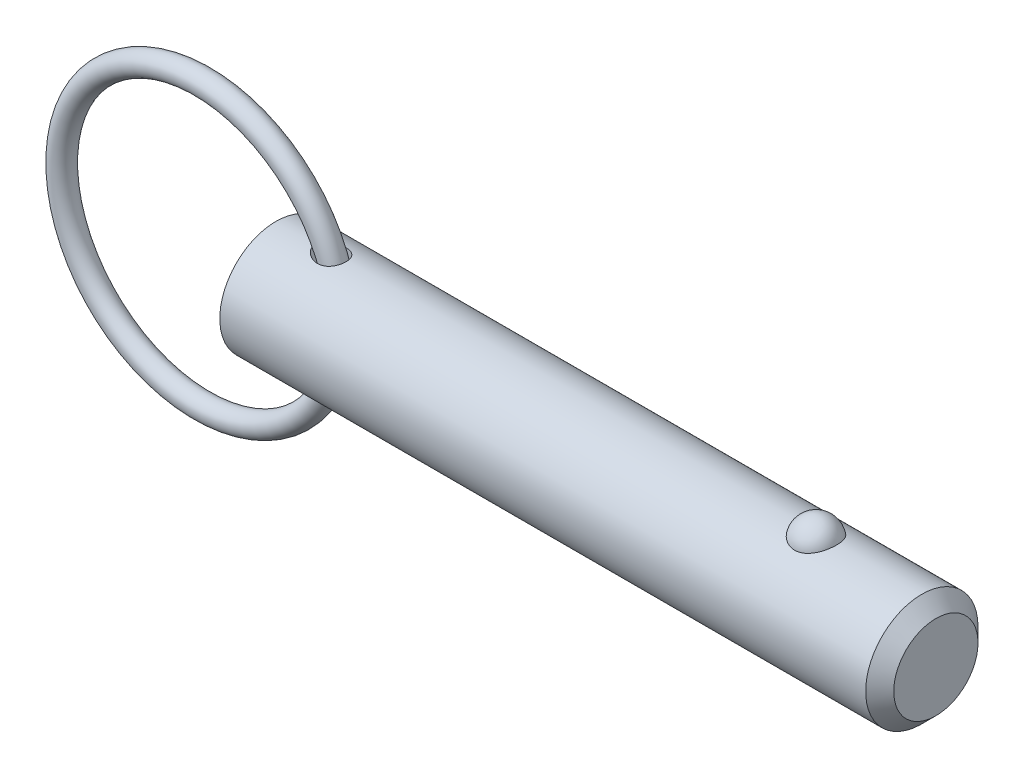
ISO-10303-21;
HEADER;
FILE_DESCRIPTION(('STEP AP214'),'2;1');
FILE_NAME('part.step','',(''),(''),'','','');
FILE_SCHEMA(('AUTOMOTIVE_DESIGN { 1 0 10303 214 1 1 1 1 }'));
ENDSEC;
DATA;
#1=APPLICATION_CONTEXT('core data for automotive mechanical design processes');
#2=APPLICATION_PROTOCOL_DEFINITION('international standard','automotive_design',2000,#1);
#3=PRODUCT_CONTEXT('',#1,'mechanical');
#4=PRODUCT('Part','Part','',(#3));
#5=PRODUCT_RELATED_PRODUCT_CATEGORY('part','',(#4));
#6=PRODUCT_DEFINITION_FORMATION('','',#4);
#7=PRODUCT_DEFINITION_CONTEXT('part definition',#1,'design');
#8=PRODUCT_DEFINITION('design','',#6,#7);
#9=PRODUCT_DEFINITION_SHAPE('','',#8);
#10=(LENGTH_UNIT() NAMED_UNIT(*) SI_UNIT(.MILLI.,.METRE.));
#11=(NAMED_UNIT(*) PLANE_ANGLE_UNIT() SI_UNIT($,.RADIAN.));
#12=(NAMED_UNIT(*) SI_UNIT($,.STERADIAN.) SOLID_ANGLE_UNIT());
#13=UNCERTAINTY_MEASURE_WITH_UNIT(LENGTH_MEASURE(1.E-05),#10,'distance_accuracy_value','');
#14=(GEOMETRIC_REPRESENTATION_CONTEXT(3) GLOBAL_UNCERTAINTY_ASSIGNED_CONTEXT((#13)) GLOBAL_UNIT_ASSIGNED_CONTEXT((#10,
#11,#12)) REPRESENTATION_CONTEXT('',''));
#15=CARTESIAN_POINT('',(0.,0.,0.));
#16=DIRECTION('',(0.,0.,1.));
#17=DIRECTION('',(1.,0.,0.));
#18=AXIS2_PLACEMENT_3D('',#15,#16,#17);
#19=CARTESIAN_POINT('',(-8.34703434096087,0.,0.));
#20=DIRECTION('',(0.,0.,1.));
#21=DIRECTION('',(1.,0.,0.));
#22=AXIS2_PLACEMENT_3D('',#19,#20,#21);
#23=TOROIDAL_SURFACE('',#22,15.875,1.27);
#24=CARTESIAN_POINT('',(8.79796565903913,0.,0.));
#25=VERTEX_POINT('',#24);
#26=VERTEX_LOOP('',#25);
#27=FACE_BOUND('',#26,.T.);
#28=ADVANCED_FACE('P0_F12',(#27),#23,.T.);
#29=CLOSED_SHELL('',(#28));
#30=MANIFOLD_SOLID_BREP('P0_B1',#29);
#31=CARTESIAN_POINT('',(0.,0.,0.));
#32=DIRECTION('',(1.,0.,0.));
#33=DIRECTION('',(0.,0.,-1.));
#34=AXIS2_PLACEMENT_3D('',#31,#32,#33);
#35=CYLINDRICAL_SURFACE('',#34,6.35);
#36=CARTESIAN_POINT('',(4.87230670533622,6.27273159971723,-0.987592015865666));
#37=CARTESIAN_POINT('',(4.94734735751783,6.26035058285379,-1.06623378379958));
#38=CARTESIAN_POINT('',(5.02968768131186,6.24755813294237,-1.13788608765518));
#39=CARTESIAN_POINT('',(5.2053426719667,6.22278258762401,-1.26640223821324));
#40=CARTESIAN_POINT('',(5.29867273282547,6.21080066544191,-1.32324497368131));
#41=CARTESIAN_POINT('',(5.49318962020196,6.18912414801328,-1.42117930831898));
#42=CARTESIAN_POINT('',(5.59435470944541,6.17942350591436,-1.46231273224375));
#43=CARTESIAN_POINT('',(5.80219659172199,6.16352555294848,-1.52793951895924));
#44=CARTESIAN_POINT('',(5.90887152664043,6.15732706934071,-1.55243845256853));
#45=CARTESIAN_POINT('',(6.12818220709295,6.14931784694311,-1.58387975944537));
#46=CARTESIAN_POINT('',(6.24090110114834,6.14763959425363,-1.59029227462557));
#47=CARTESIAN_POINT('',(6.46560233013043,6.14965588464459,-1.58248630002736));
#48=CARTESIAN_POINT('',(6.57758514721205,6.15334646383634,-1.56828303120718));
#49=CARTESIAN_POINT('',(6.78516594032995,6.1652116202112,-1.52091398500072));
#50=CARTESIAN_POINT('',(6.88126802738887,6.17288876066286,-1.48983713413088));
#51=CARTESIAN_POINT('',(7.06576629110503,6.19149190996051,-1.41052329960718));
#52=CARTESIAN_POINT('',(7.15416739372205,6.20241582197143,-1.36229738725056));
#53=CARTESIAN_POINT('',(7.31166929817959,6.2248616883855,-1.25548983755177));
#54=CARTESIAN_POINT('',(7.3818144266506,6.23621734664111,-1.19840625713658));
#55=CARTESIAN_POINT('',(7.51101296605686,6.259037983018,-1.07284763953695));
#56=CARTESIAN_POINT('',(7.57006844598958,6.2705029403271,-1.00437473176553));
#57=CARTESIAN_POINT('',(7.6737469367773,6.29184873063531,-0.860384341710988));
#58=CARTESIAN_POINT('',(7.71876694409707,6.30176816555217,-0.785157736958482));
#59=CARTESIAN_POINT('',(7.79574491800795,6.31935829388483,-0.628053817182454));
#60=CARTESIAN_POINT('',(7.82770308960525,6.32702902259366,-0.546176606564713));
#61=CARTESIAN_POINT('',(7.87788845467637,6.33930929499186,-0.377876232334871));
#62=CARTESIAN_POINT('',(7.89608106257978,6.34391112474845,-0.291442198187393));
#63=CARTESIAN_POINT('',(7.9182072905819,6.34953044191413,-0.116652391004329));
#64=CARTESIAN_POINT('',(7.92214044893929,6.35054781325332,-0.0282965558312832));
#65=CARTESIAN_POINT('',(7.91564686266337,6.34888556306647,0.148263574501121));
#66=CARTESIAN_POINT('',(7.90515337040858,6.34618875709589,0.236465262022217));
#67=CARTESIAN_POINT('',(7.8699153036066,6.33735741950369,0.409798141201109));
#68=CARTESIAN_POINT('',(7.84517062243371,6.33122286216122,0.494929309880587));
#69=CARTESIAN_POINT('',(7.7819985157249,6.31618517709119,0.659657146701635));
#70=CARTESIAN_POINT('',(7.74357645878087,6.30728313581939,0.739255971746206));
#71=CARTESIAN_POINT('',(7.65396632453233,6.28769050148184,0.890663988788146));
#72=CARTESIAN_POINT('',(7.60277911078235,6.27700002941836,0.962473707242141));
#73=CARTESIAN_POINT('',(7.48925881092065,6.2550822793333,1.09590260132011));
#74=CARTESIAN_POINT('',(7.42698604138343,6.24385813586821,1.15757361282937));
#75=CARTESIAN_POINT('',(7.29283556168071,6.2220655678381,1.26951234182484));
#76=CARTESIAN_POINT('',(7.22095880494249,6.21149707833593,1.31978118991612));
#77=CARTESIAN_POINT('',(7.06971853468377,6.19216002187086,1.40772509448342));
#78=CARTESIAN_POINT('',(6.99035873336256,6.18339056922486,1.44540635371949));
#79=CARTESIAN_POINT('',(6.82642723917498,6.16851603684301,1.50762653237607));
#80=CARTESIAN_POINT('',(6.7418548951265,6.16241129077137,1.53216380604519));
#81=CARTESIAN_POINT('',(6.56686412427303,6.15321474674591,1.56869994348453));
#82=CARTESIAN_POINT('',(6.47634467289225,6.15023369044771,1.58023897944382));
#83=CARTESIAN_POINT('',(6.29456956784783,6.14778331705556,1.58974172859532));
#84=CARTESIAN_POINT('',(6.20331368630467,6.1483151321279,1.58770106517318));
#85=CARTESIAN_POINT('',(6.01385969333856,6.15284811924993,1.5700487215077));
#86=CARTESIAN_POINT('',(5.91578322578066,6.15715979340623,1.55322212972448));
#87=CARTESIAN_POINT('',(5.72331909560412,6.16902415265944,1.5054032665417));
#88=CARTESIAN_POINT('',(5.6289344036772,6.17657939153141,1.4743998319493));
#89=CARTESIAN_POINT('',(5.4357260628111,6.19502494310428,1.39499475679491));
#90=CARTESIAN_POINT('',(5.33755891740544,6.20619097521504,1.34505268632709));
#91=CARTESIAN_POINT('',(5.15090047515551,6.23006191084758,1.22975103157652));
#92=CARTESIAN_POINT('',(5.06240741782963,6.24276653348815,1.16439425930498));
#93=CARTESIAN_POINT('',(4.91171642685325,6.26607433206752,1.03083814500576));
#94=CARTESIAN_POINT('',(4.84758224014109,6.27668356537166,0.964825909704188));
#95=CARTESIAN_POINT('',(4.73090054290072,6.29683133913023,0.823112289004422));
#96=CARTESIAN_POINT('',(4.67833688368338,6.30637136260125,0.747424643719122));
#97=CARTESIAN_POINT('',(4.59543145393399,6.32183254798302,0.601150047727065));
#98=CARTESIAN_POINT('',(4.56283099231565,6.32809321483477,0.531883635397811));
#99=CARTESIAN_POINT('',(4.50941370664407,6.33849198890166,0.388778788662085));
#100=CARTESIAN_POINT('',(4.48858876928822,6.34263155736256,0.314943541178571));
#101=CARTESIAN_POINT('',(4.46008864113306,6.3483236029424,0.164282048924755));
#102=CARTESIAN_POINT('',(4.45247558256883,6.34986385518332,0.08744340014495));
#103=CARTESIAN_POINT('',(4.45121096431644,6.35011863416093,-0.0663538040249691));
#104=CARTESIAN_POINT('',(4.45755802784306,6.34883343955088,-0.143312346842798));
#105=CARTESIAN_POINT('',(4.48267656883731,6.34380948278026,-0.288945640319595));
#106=CARTESIAN_POINT('',(4.50045680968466,6.34026665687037,-0.357802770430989));
#107=CARTESIAN_POINT('',(4.54636050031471,6.33128211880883,-0.491815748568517));
#108=CARTESIAN_POINT('',(4.57448566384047,6.32584009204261,-0.556970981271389));
#109=CARTESIAN_POINT('',(4.64209700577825,6.31308107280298,-0.687092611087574));
#110=CARTESIAN_POINT('',(4.68226903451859,6.30565525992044,-0.751689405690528));
#111=CARTESIAN_POINT('',(4.77120834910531,6.28979741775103,-0.874524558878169));
#112=CARTESIAN_POINT('',(4.81998302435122,6.28136452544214,-0.932757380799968));
#113=CARTESIAN_POINT('',(4.87230670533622,6.27273159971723,-0.987592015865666));
#114=B_SPLINE_CURVE_WITH_KNOTS('',3,(#36,#37,#38,#39,#40,#41,#42,#43,#44,#45,#46,#47,#48,#49,
#50,#51,#52,#53,#54,#55,#56,#57,#58,#59,#60,#61,#62,#63,#64,#65,#66,#67,#68,#69,#70,#71,#72,#73,
#74,#75,#76,#77,#78,#79,#80,#81,#82,#83,#84,#85,#86,#87,#88,#89,#90,#91,#92,#93,#94,#95,#96,#97,
#98,#99,#100,#101,#102,#103,#104,#105,#106,#107,#108,#109,#110,#111,#112,#113),.UNSPECIFIED.,
.T.,.F.,(4,2,2,2,2,2,2,2,2,2,2,2,2,2,2,2,2,2,2,2,2,2,2,2,2,2,2,2,2,2,2,2,2,2,2,2,2,2,4),(0.,
0.327902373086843,0.65626964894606,0.983756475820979,1.31113357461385,1.64800657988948,
1.98463099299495,2.28681225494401,2.58879878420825,2.86088594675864,3.13292229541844,
3.3963648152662,3.65980320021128,3.92390128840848,4.18800792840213,4.45334062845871,
4.7186753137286,4.98390596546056,5.24911867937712,5.51293017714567,5.7767155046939,
6.04037065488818,6.30405880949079,6.57680801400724,6.84964512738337,7.14724526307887,
7.44508014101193,7.77572668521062,8.10631295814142,8.38318772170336,8.65967357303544,
8.88915303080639,9.11847418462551,9.34887088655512,9.57924486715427,9.79193291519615,
10.0046562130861,10.2330958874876,10.4617327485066),.UNSPECIFIED.);
#115=CARTESIAN_POINT('',(4.87230670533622,6.27273159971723,-0.987592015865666));
#116=VERTEX_POINT('',#115);
#117=EDGE_CURVE('P1_E40',#116,#116,#114,.T.);
#118=ORIENTED_EDGE('',*,*,#117,.T.);
#119=EDGE_LOOP('',(#118));
#120=FACE_BOUND('',#119,.T.);
#121=CARTESIAN_POINT('',(73.0125,0.,0.));
#122=DIRECTION('',(1.,0.,0.));
#123=DIRECTION('',(0.,0.,-1.));
#124=AXIS2_PLACEMENT_3D('',#121,#122,#123);
#125=CIRCLE('',#124,6.35);
#126=CARTESIAN_POINT('',(73.0125,0.,-6.35));
#127=VERTEX_POINT('',#126);
#128=EDGE_CURVE('P1_E25',#127,#127,#125,.T.);
#129=ORIENTED_EDGE('',*,*,#128,.F.);
#130=EDGE_LOOP('',(#129));
#131=FACE_BOUND('',#130,.T.);
#132=CARTESIAN_POINT('',(0.,0.,0.));
#133=DIRECTION('',(1.,0.,0.));
#134=DIRECTION('',(0.,0.,-1.));
#135=AXIS2_PLACEMENT_3D('',#132,#133,#134);
#136=CIRCLE('',#135,6.35);
#137=CARTESIAN_POINT('',(0.,0.,-6.35));
#138=VERTEX_POINT('',#137);
#139=EDGE_CURVE('P1_E9',#138,#138,#136,.T.);
#140=ORIENTED_EDGE('',*,*,#139,.T.);
#141=EDGE_LOOP('',(#140));
#142=FACE_BOUND('',#141,.T.);
#143=CARTESIAN_POINT('',(61.0500214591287,5.87502187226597,2.40969251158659));
#144=CARTESIAN_POINT('',(60.9250305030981,5.87501645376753,2.40969773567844));
#145=CARTESIAN_POINT('',(60.8000806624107,5.87916061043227,2.39967292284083));
#146=CARTESIAN_POINT('',(60.5539091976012,5.8952311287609,2.3599173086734));
#147=CARTESIAN_POINT('',(60.4326863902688,5.90715499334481,2.33019283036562));
#148=CARTESIAN_POINT('',(60.1975170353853,5.93739567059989,2.25201402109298));
#149=CARTESIAN_POINT('',(60.0835602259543,5.95570321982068,2.20358681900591));
#150=CARTESIAN_POINT('',(59.86557352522,5.99672067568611,2.08937987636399));
#151=CARTESIAN_POINT('',(59.7615457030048,6.01943149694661,2.02359652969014));
#152=CARTESIAN_POINT('',(59.5629437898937,6.06760647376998,1.87428969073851));
#153=CARTESIAN_POINT('',(59.4687268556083,6.09313095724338,1.79031110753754));
#154=CARTESIAN_POINT('',(59.2952557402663,6.14375873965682,1.60800178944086));
#155=CARTESIAN_POINT('',(59.2160043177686,6.16886196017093,1.50966841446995));
#156=CARTESIAN_POINT('',(59.0708457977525,6.21724600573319,1.29645884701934));
#157=CARTESIAN_POINT('',(59.0056885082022,6.24039621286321,1.18104158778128));
#158=CARTESIAN_POINT('',(58.8947035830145,6.28117277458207,0.940351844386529));
#159=CARTESIAN_POINT('',(58.8488776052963,6.29879865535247,0.815078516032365));
#160=CARTESIAN_POINT('',(58.7770234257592,6.32692073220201,0.556494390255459));
#161=CARTESIAN_POINT('',(58.751249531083,6.33732517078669,0.423102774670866));
#162=CARTESIAN_POINT('',(58.7209885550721,6.34957673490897,0.15354272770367));
#163=CARTESIAN_POINT('',(58.7165009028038,6.35142408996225,0.0173743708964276));
#164=CARTESIAN_POINT('',(58.7288655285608,6.34638925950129,-0.253036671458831));
#165=CARTESIAN_POINT('',(58.7455949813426,6.33955731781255,-0.387285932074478));
#166=CARTESIAN_POINT('',(58.799843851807,6.31794129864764,-0.650851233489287));
#167=CARTESIAN_POINT('',(58.8373636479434,6.30315707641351,-0.780167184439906));
#168=CARTESIAN_POINT('',(58.932500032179,6.26711642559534,-1.03041949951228));
#169=CARTESIAN_POINT('',(58.990143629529,6.24585130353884,-1.15134433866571));
#170=CARTESIAN_POINT('',(59.1243522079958,6.19905619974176,-1.38129800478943));
#171=CARTESIAN_POINT('',(59.2009187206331,6.17352587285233,-1.49032586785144));
#172=CARTESIAN_POINT('',(59.3717538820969,6.12080227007,-1.69393164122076));
#173=CARTESIAN_POINT('',(59.4661008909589,6.09360200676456,-1.78844209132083));
#174=CARTESIAN_POINT('',(59.6701196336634,6.04070434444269,-1.95970536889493));
#175=CARTESIAN_POINT('',(59.7797900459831,6.01500681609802,-2.03645972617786));
#176=CARTESIAN_POINT('',(60.0091876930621,5.96867714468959,-2.1684564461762));
#177=CARTESIAN_POINT('',(60.1286522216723,5.94794910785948,-2.2241206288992));
#178=CARTESIAN_POINT('',(60.3762188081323,5.91340580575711,-2.31440992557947));
#179=CARTESIAN_POINT('',(60.5043175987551,5.89958794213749,-2.3490429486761));
#180=CARTESIAN_POINT('',(60.758582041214,5.88111049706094,-2.39491590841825));
#181=CARTESIAN_POINT('',(60.8845207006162,5.87602512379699,-2.40724512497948));
#182=CARTESIAN_POINT('',(61.1367867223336,5.87428980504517,-2.41147867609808));
#183=CARTESIAN_POINT('',(61.263114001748,5.87763817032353,-2.40338710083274));
#184=CARTESIAN_POINT('',(61.5084170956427,5.89212921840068,-2.36762715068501));
#185=CARTESIAN_POINT('',(61.6274992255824,5.90302431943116,-2.34058030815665));
#186=CARTESIAN_POINT('',(61.8592447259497,5.93113752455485,-2.26839066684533));
#187=CARTESIAN_POINT('',(61.9719075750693,5.94835614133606,-2.22324640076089));
#188=CARTESIAN_POINT('',(62.1904009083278,5.98773016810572,-2.11493806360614));
#189=CARTESIAN_POINT('',(62.296028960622,6.00998499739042,-2.05140269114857));
#190=CARTESIAN_POINT('',(62.4953006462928,6.05690144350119,-1.90842705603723));
#191=CARTESIAN_POINT('',(62.5889415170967,6.08156361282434,-1.8289831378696));
#192=CARTESIAN_POINT('',(62.7666754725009,6.13211715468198,-1.65182429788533));
#193=CARTESIAN_POINT('',(62.850055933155,6.15800825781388,-1.55339381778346));
#194=CARTESIAN_POINT('',(62.9997900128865,6.20712834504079,-1.34374214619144));
#195=CARTESIAN_POINT('',(63.0661405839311,6.23035685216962,-1.23251867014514));
#196=CARTESIAN_POINT('',(63.1823455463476,6.27251177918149,-0.996447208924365));
#197=CARTESIAN_POINT('',(63.2316072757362,6.29127762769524,-0.871278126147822));
#198=CARTESIAN_POINT('',(63.3096142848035,6.3215862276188,-0.613870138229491));
#199=CARTESIAN_POINT('',(63.3383593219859,6.33312889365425,-0.481631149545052));
#200=CARTESIAN_POINT('',(63.3747705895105,6.34782349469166,-0.213672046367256));
#201=CARTESIAN_POINT('',(63.3824134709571,6.35096613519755,-0.0779482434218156));
#202=CARTESIAN_POINT('',(63.3763951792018,6.34851322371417,0.192943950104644));
#203=CARTESIAN_POINT('',(63.3627343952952,6.3429178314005,0.328112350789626));
#204=CARTESIAN_POINT('',(63.3145036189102,6.32360512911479,0.593406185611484));
#205=CARTESIAN_POINT('',(63.2800313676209,6.30992579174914,0.723552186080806));
#206=CARTESIAN_POINT('',(63.1909539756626,6.27586325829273,0.975834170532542));
#207=CARTESIAN_POINT('',(63.1363476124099,6.25547965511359,1.09796966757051));
#208=CARTESIAN_POINT('',(63.0077587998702,6.20998183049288,1.33148921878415));
#209=CARTESIAN_POINT('',(62.9336742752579,6.18484288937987,1.44281227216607));
#210=CARTESIAN_POINT('',(62.7678204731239,6.13258735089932,1.65087683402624));
#211=CARTESIAN_POINT('',(62.6760515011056,6.10547078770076,1.74761859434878));
#212=CARTESIAN_POINT('',(62.4771839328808,6.0523587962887,1.92350926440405));
#213=CARTESIAN_POINT('',(62.370133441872,6.0263601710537,2.00271146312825));
#214=CARTESIAN_POINT('',(62.1431384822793,5.97843747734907,2.14154159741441));
#215=CARTESIAN_POINT('',(62.023191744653,5.95651412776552,2.20116608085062));
#216=CARTESIAN_POINT('',(61.7645236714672,5.91812106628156,2.30250570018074));
#217=CARTESIAN_POINT('',(61.6250698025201,5.90217533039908,2.34256795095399));
#218=CARTESIAN_POINT('',(61.3403974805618,5.88063128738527,2.39615214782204));
#219=CARTESIAN_POINT('',(61.1951817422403,5.8750281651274,2.40968644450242));
#220=CARTESIAN_POINT('',(61.0500214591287,5.87502187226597,2.40969251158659));
#221=B_SPLINE_CURVE_WITH_KNOTS('',3,(#143,#144,#145,#146,#147,#148,#149,#150,#151,#152,#153,
#154,#155,#156,#157,#158,#159,#160,#161,#162,#163,#164,#165,#166,#167,#168,#169,#170,#171,#172,
#173,#174,#175,#176,#177,#178,#179,#180,#181,#182,#183,#184,#185,#186,#187,#188,#189,#190,#191,
#192,#193,#194,#195,#196,#197,#198,#199,#200,#201,#202,#203,#204,#205,#206,#207,#208,#209,#210,
#211,#212,#213,#214,#215,#216,#217,#218,#219,#220),.UNSPECIFIED.,.T.,.F.,(4,2,2,2,2,2,2,2,2,2,2,
2,2,2,2,2,2,2,2,2,2,2,2,2,2,2,2,2,2,2,2,2,2,2,2,2,2,2,4),(0.,0.374440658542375,0.74876119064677,
1.12254078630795,1.49639810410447,1.88098871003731,2.26565013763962,2.6674110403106,
3.06920639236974,3.47601794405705,3.88281858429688,4.28727498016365,4.69173873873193,
5.09674745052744,5.50178895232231,5.90865911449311,6.31549420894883,6.71369855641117,
7.11175305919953,7.48978077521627,7.86773278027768,8.2338388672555,8.59997464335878,
8.97409044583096,9.34829231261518,9.74122667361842,10.1342313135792,10.5397522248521,
10.9452779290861,11.3512521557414,11.7572189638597,12.1612938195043,12.5653932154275,
12.9716540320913,13.3779078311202,13.7829098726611,14.1879832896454,14.6230486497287,
15.0579114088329),.UNSPECIFIED.);
#222=CARTESIAN_POINT('',(61.0500214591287,5.87502187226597,2.40969251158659));
#223=VERTEX_POINT('',#222);
#224=EDGE_CURVE('P1_E34',#223,#223,#221,.T.);
#225=ORIENTED_EDGE('',*,*,#224,.T.);
#226=EDGE_LOOP('',(#225));
#227=FACE_BOUND('',#226,.T.);
#228=CARTESIAN_POINT('',(4.87230670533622,-6.27273159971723,-0.987592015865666));
#229=CARTESIAN_POINT('',(4.81440819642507,-6.28228431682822,-0.926913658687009));
#230=CARTESIAN_POINT('',(4.76085022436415,-6.29159289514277,-0.862071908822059));
#231=CARTESIAN_POINT('',(4.66448472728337,-6.3088950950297,-0.72465504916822));
#232=CARTESIAN_POINT('',(4.62166818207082,-6.31688981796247,-0.652086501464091));
#233=CARTESIAN_POINT('',(4.54882773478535,-6.33076917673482,-0.49974775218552));
#234=CARTESIAN_POINT('',(4.51891553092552,-6.33663532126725,-0.419921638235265));
#235=CARTESIAN_POINT('',(4.47476924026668,-6.3453711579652,-0.255882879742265));
#236=CARTESIAN_POINT('',(4.46051880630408,-6.34824397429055,-0.171674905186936));
#237=CARTESIAN_POINT('',(4.44966179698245,-6.35043041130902,-0.0120763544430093));
#238=CARTESIAN_POINT('',(4.45117530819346,-6.35012328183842,0.0631849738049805));
#239=CARTESIAN_POINT('',(4.46726452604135,-6.34689000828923,0.212230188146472));
#240=CARTESIAN_POINT('',(4.48184026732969,-6.3439638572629,0.286014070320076));
#241=CARTESIAN_POINT('',(4.52202068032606,-6.33603071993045,0.426550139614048));
#242=CARTESIAN_POINT('',(4.54707079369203,-6.33112875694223,0.493469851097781));
#243=CARTESIAN_POINT('',(4.6066985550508,-6.31972370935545,0.622743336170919));
#244=CARTESIAN_POINT('',(4.64127887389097,-6.31322017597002,0.685095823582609));
#245=CARTESIAN_POINT('',(4.72328142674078,-6.29826068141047,0.811769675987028));
#246=CARTESIAN_POINT('',(4.77176118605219,-6.28966287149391,0.875386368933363));
#247=CARTESIAN_POINT('',(4.87703902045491,-6.27182325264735,0.99519278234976));
#248=CARTESIAN_POINT('',(4.93384225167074,-6.26258104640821,1.05137785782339));
#249=CARTESIAN_POINT('',(5.0661743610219,-6.24228878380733,1.16635591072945));
#250=CARTESIAN_POINT('',(5.1431816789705,-6.23124423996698,1.22345054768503));
#251=CARTESIAN_POINT('',(5.30475767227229,-6.21023402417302,1.32598441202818));
#252=CARTESIAN_POINT('',(5.3893323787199,-6.20026922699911,1.37141422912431));
#253=CARTESIAN_POINT('',(5.5776013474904,-6.18099350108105,1.45601817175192));
#254=CARTESIAN_POINT('',(5.68224348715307,-6.17201456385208,1.4931788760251));
#255=CARTESIAN_POINT('',(5.89649087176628,-6.15800474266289,1.5499484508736));
#256=CARTESIAN_POINT('',(6.00609708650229,-6.15297463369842,1.56955387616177));
#257=CARTESIAN_POINT('',(6.22752772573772,-6.14779725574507,1.58971993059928));
#258=CARTESIAN_POINT('',(6.33935715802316,-6.14766266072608,1.59023112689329));
#259=CARTESIAN_POINT('',(6.56108231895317,-6.15269227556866,1.57066564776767));
#260=CARTESIAN_POINT('',(6.67097982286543,-6.15785133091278,1.55060899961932));
#261=CARTESIAN_POINT('',(6.87257705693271,-6.17211580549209,1.4927326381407));
#262=CARTESIAN_POINT('',(6.96494608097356,-6.18072242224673,1.45711948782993));
#263=CARTESIAN_POINT('',(7.14129343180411,-6.20069920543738,1.36960980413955));
#264=CARTESIAN_POINT('',(7.22527609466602,-6.21206793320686,1.31772174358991));
#265=CARTESIAN_POINT('',(7.37471505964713,-6.23497047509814,1.20443359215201));
#266=CARTESIAN_POINT('',(7.44115811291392,-6.24639757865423,1.14430788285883));
#267=CARTESIAN_POINT('',(7.5626186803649,-6.26896339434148,1.0134084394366));
#268=CARTESIAN_POINT('',(7.61763801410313,-6.28010215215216,0.942636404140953));
#269=CARTESIAN_POINT('',(7.71360563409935,-6.30055923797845,0.794304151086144));
#270=CARTESIAN_POINT('',(7.75485562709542,-6.3099143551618,0.716943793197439));
#271=CARTESIAN_POINT('',(7.82406051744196,-6.32610528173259,0.556244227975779));
#272=CARTESIAN_POINT('',(7.8520154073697,-6.33294108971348,0.472905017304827));
#273=CARTESIAN_POINT('',(7.89408663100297,-6.34338077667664,0.302249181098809));
#274=CARTESIAN_POINT('',(7.90814615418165,-6.34697138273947,0.214917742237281));
#275=CARTESIAN_POINT('',(7.92192329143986,-6.35048887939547,0.0390564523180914));
#276=CARTESIAN_POINT('',(7.92164046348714,-6.3504156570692,-0.0494734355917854));
#277=CARTESIAN_POINT('',(7.90670754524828,-6.34660520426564,-0.225592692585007));
#278=CARTESIAN_POINT('',(7.89199989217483,-6.34285329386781,-0.31317687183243));
#279=CARTESIAN_POINT('',(7.8484534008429,-6.33206809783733,-0.484549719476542));
#280=CARTESIAN_POINT('',(7.81961455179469,-6.32503480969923,-0.568338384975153));
#281=CARTESIAN_POINT('',(7.74850591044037,-6.30846389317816,-0.729625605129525));
#282=CARTESIAN_POINT('',(7.70625193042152,-6.29892921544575,-0.807131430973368));
#283=CARTESIAN_POINT('',(7.60933437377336,-6.27840608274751,-0.953731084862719));
#284=CARTESIAN_POINT('',(7.55467181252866,-6.2674177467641,-1.02282560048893));
#285=CARTESIAN_POINT('',(7.43471786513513,-6.24527869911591,-1.15028913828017));
#286=CARTESIAN_POINT('',(7.36948829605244,-6.23412925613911,-1.20871657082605));
#287=CARTESIAN_POINT('',(7.23001723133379,-6.21283678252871,-1.3137894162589));
#288=CARTESIAN_POINT('',(7.15577649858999,-6.20269366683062,-1.36043582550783));
#289=CARTESIAN_POINT('',(7.00025986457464,-6.18446636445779,-1.4410399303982));
#290=CARTESIAN_POINT('',(6.91896776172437,-6.17638709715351,-1.47496739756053));
#291=CARTESIAN_POINT('',(6.75184232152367,-6.16309237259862,-1.52957024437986));
#292=CARTESIAN_POINT('',(6.66600814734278,-6.15787744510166,-1.55024317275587));
#293=CARTESIAN_POINT('',(6.48842585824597,-6.15055064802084,-1.57906962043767));
#294=CARTESIAN_POINT('',(6.39658108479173,-6.14857915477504,-1.58665744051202));
#295=CARTESIAN_POINT('',(6.2127983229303,-6.14817707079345,-1.58821048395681));
#296=CARTESIAN_POINT('',(6.12086031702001,-6.14974736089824,-1.58217231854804));
#297=CARTESIAN_POINT('',(5.92996902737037,-6.15640095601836,-1.55609403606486));
#298=CARTESIAN_POINT('',(5.83120653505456,-6.16181208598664,-1.53474519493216));
#299=CARTESIAN_POINT('',(5.63804881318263,-6.17573474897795,-1.47771859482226));
#300=CARTESIAN_POINT('',(5.54365953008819,-6.18425037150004,-1.44202192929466));
#301=CARTESIAN_POINT('',(5.34413923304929,-6.20522938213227,-1.34918979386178));
#302=CARTESIAN_POINT('',(5.24033140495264,-6.21813417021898,-1.28928337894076));
#303=CARTESIAN_POINT('',(5.04554233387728,-6.24510162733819,-1.15156760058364));
#304=CARTESIAN_POINT('',(4.9545459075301,-6.25916289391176,-1.07377972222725));
#305=CARTESIAN_POINT('',(4.87230670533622,-6.27273159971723,-0.987592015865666));
#306=B_SPLINE_CURVE_WITH_KNOTS('',3,(#228,#229,#230,#231,#232,#233,#234,#235,#236,#237,#238,
#239,#240,#241,#242,#243,#244,#245,#246,#247,#248,#249,#250,#251,#252,#253,#254,#255,#256,#257,
#258,#259,#260,#261,#262,#263,#264,#265,#266,#267,#268,#269,#270,#271,#272,#273,#274,#275,#276,
#277,#278,#279,#280,#281,#282,#283,#284,#285,#286,#287,#288,#289,#290,#291,#292,#293,#294,#295,
#296,#297,#298,#299,#300,#301,#302,#303,#304,#305),.UNSPECIFIED.,.T.,.F.,(4,2,2,2,2,2,2,2,2,2,2,
2,2,2,2,2,2,2,2,2,2,2,2,2,2,2,2,2,2,2,2,2,2,2,2,2,2,2,4),(0.,0.252951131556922,
0.505689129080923,0.760572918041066,1.01519041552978,1.23982791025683,1.46446600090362,
1.67847364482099,1.89254132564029,2.13299551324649,2.37359928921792,2.6619896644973,
2.95061196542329,3.28329078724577,3.61603488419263,3.9496403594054,4.28292130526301,
4.57939201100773,4.87570862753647,5.14538810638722,5.41502459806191,5.67829123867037,
5.94155802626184,6.20589676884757,6.47024365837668,6.73564974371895,7.00105603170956,
7.26615064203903,7.53122356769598,7.79479837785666,8.05835088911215,8.32252586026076,
8.58674967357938,8.86213419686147,9.137587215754,9.43991696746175,9.74264642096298,
10.1023688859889,10.461661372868),.UNSPECIFIED.);
#307=CARTESIAN_POINT('',(4.87230670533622,-6.27273159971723,-0.987592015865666));
#308=VERTEX_POINT('',#307);
#309=EDGE_CURVE('P1_E17',#308,#308,#306,.T.);
#310=ORIENTED_EDGE('',*,*,#309,.T.);
#311=EDGE_LOOP('',(#310));
#312=FACE_BOUND('',#311,.T.);
#313=ADVANCED_FACE('P1_F13',(#120,#131,#142,#227,#312),#35,.T.);
#314=CARTESIAN_POINT('',(0.,0.,0.));
#315=DIRECTION('',(-1.,0.,0.));
#316=DIRECTION('',(0.,0.,1.));
#317=AXIS2_PLACEMENT_3D('',#314,#315,#316);
#318=PLANE('',#317);
#319=ORIENTED_EDGE('',*,*,#139,.F.);
#320=EDGE_LOOP('',(#319));
#321=FACE_BOUND('',#320,.T.);
#322=ADVANCED_FACE('P1_F15',(#321),#318,.T.);
#323=CARTESIAN_POINT('',(74.6,0.,0.));
#324=DIRECTION('',(-1.,0.,0.));
#325=DIRECTION('',(0.,0.,1.));
#326=AXIS2_PLACEMENT_3D('',#323,#324,#325);
#327=CONICAL_SURFACE('',#326,4.76250000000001,0.785398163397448);
#328=ORIENTED_EDGE('',*,*,#128,.T.);
#329=EDGE_LOOP('',(#328));
#330=FACE_BOUND('',#329,.T.);
#331=CARTESIAN_POINT('',(74.6,0.,0.));
#332=DIRECTION('',(1.,0.,0.));
#333=DIRECTION('',(0.,0.,-1.));
#334=AXIS2_PLACEMENT_3D('',#331,#332,#333);
#335=CIRCLE('',#334,4.76250000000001);
#336=CARTESIAN_POINT('',(74.6,0.,-4.76250000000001));
#337=VERTEX_POINT('',#336);
#338=EDGE_CURVE('P1_E30',#337,#337,#335,.T.);
#339=ORIENTED_EDGE('',*,*,#338,.F.);
#340=EDGE_LOOP('',(#339));
#341=FACE_BOUND('',#340,.T.);
#342=ADVANCED_FACE('P1_F55',(#330,#341),#327,.T.);
#343=CARTESIAN_POINT('',(74.6,4.76250000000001,0.));
#344=DIRECTION('',(1.,0.,0.));
#345=DIRECTION('',(0.,0.,-1.));
#346=AXIS2_PLACEMENT_3D('',#343,#344,#345);
#347=PLANE('',#346);
#348=ORIENTED_EDGE('',*,*,#338,.T.);
#349=EDGE_LOOP('',(#348));
#350=FACE_BOUND('',#349,.T.);
#351=ADVANCED_FACE('P1_F51',(#350),#347,.T.);
#352=CARTESIAN_POINT('',(61.0500214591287,5.715,0.));
#353=DIRECTION('',(-1.,0.,0.));
#354=DIRECTION('',(0.,1.,0.));
#355=AXIS2_PLACEMENT_3D('',#352,#353,#354);
#356=SPHERICAL_SURFACE('',#355,2.415);
#357=ORIENTED_EDGE('',*,*,#224,.F.);
#358=EDGE_LOOP('',(#357));
#359=FACE_BOUND('',#358,.T.);
#360=ADVANCED_FACE('P1_F46',(#359),#356,.T.);
#361=CARTESIAN_POINT('',(-8.34703434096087,0.,0.));
#362=DIRECTION('',(0.,0.,1.));
#363=DIRECTION('',(1.,0.,0.));
#364=AXIS2_PLACEMENT_3D('',#361,#362,#363);
#365=TOROIDAL_SURFACE('',#364,15.875,1.5875);
#366=ORIENTED_EDGE('',*,*,#309,.F.);
#367=EDGE_LOOP('',(#366));
#368=FACE_BOUND('',#367,.T.);
#369=ORIENTED_EDGE('',*,*,#117,.F.);
#370=EDGE_LOOP('',(#369));
#371=FACE_BOUND('',#370,.T.);
#372=ADVANCED_FACE('P1_F50',(#368,#371),#365,.F.);
#373=CLOSED_SHELL('',(#313,#322,#342,#351,#360,#372));
#374=MANIFOLD_SOLID_BREP('P1_B1',#373);
#375=ADVANCED_BREP_SHAPE_REPRESENTATION('',(#18,#30,#374),#14);
#376=SHAPE_DEFINITION_REPRESENTATION(#9,#375);
ENDSEC;
END-ISO-10303-21;
